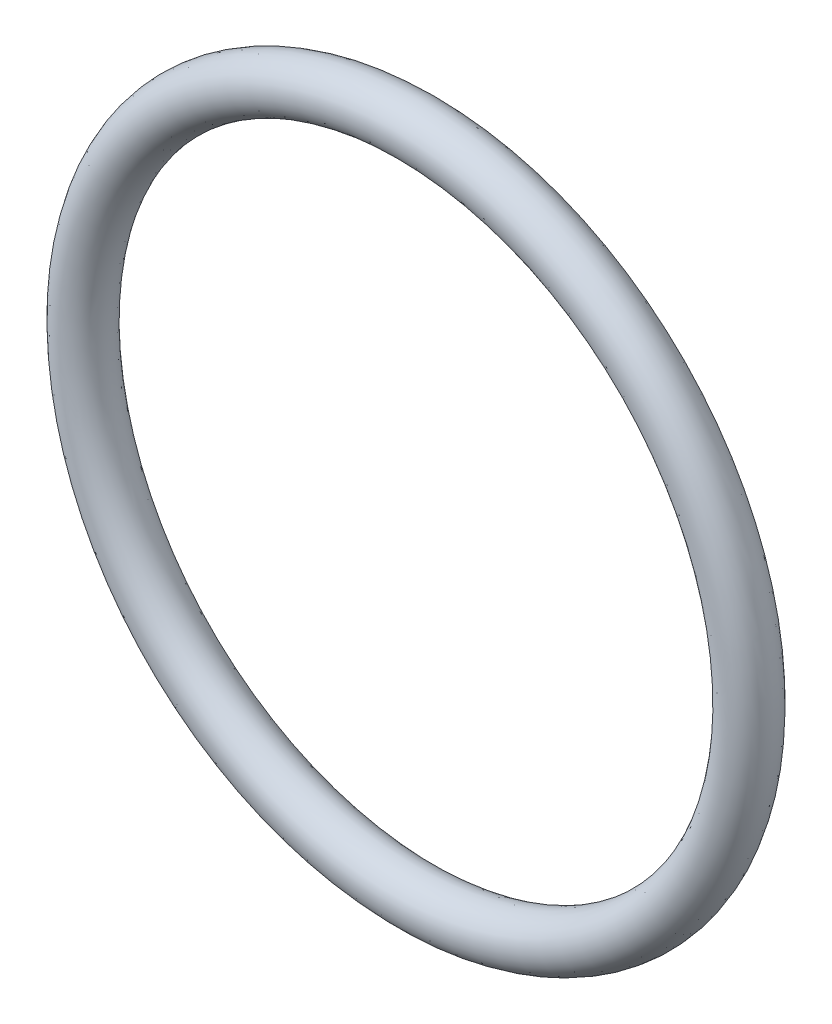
from build123d import *

# Parameters (mm, degrees)
SKETCH1_RX = 1
SKETCH1_RY = 1


with BuildPart() as part:
    # Sketch1 → Revolve1 (revolve)
    with BuildSketch(Plane(origin=(0, 0, 0), x_dir=(0, 0, -1), z_dir=(1, 0, 0))):
        with Locations(Location((-1, 13), (0, 0, -90))):
            Ellipse(SKETCH1_RX, SKETCH1_RY)
    revolve(axis=Axis((0, 0, 2), (0, 0, -1)))


solid = part.part
